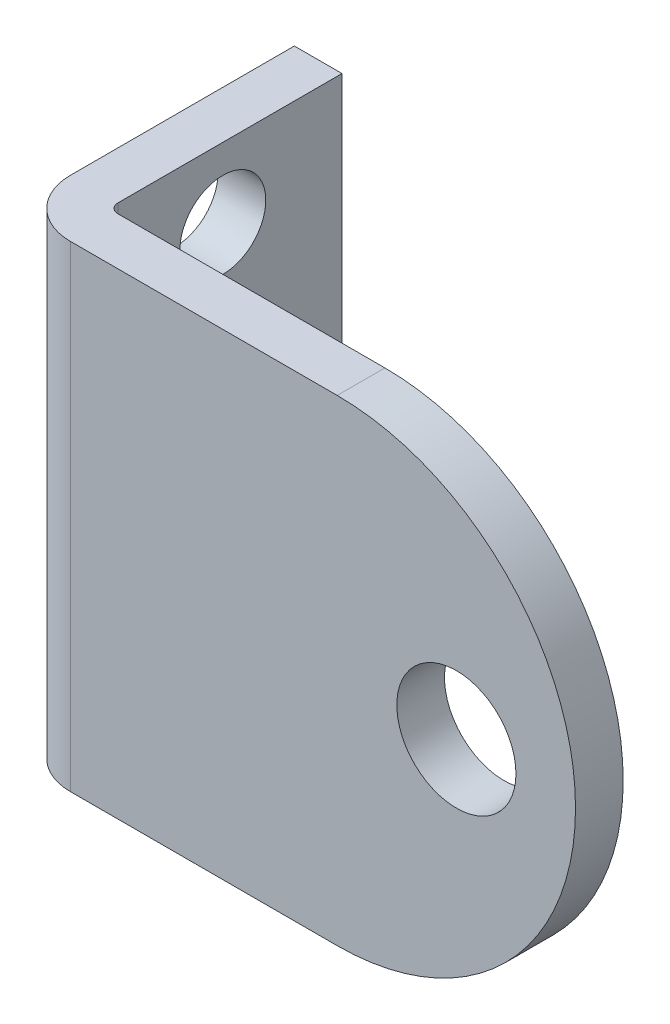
ISO-10303-21;
HEADER;
FILE_DESCRIPTION(('STEP AP214'),'2;1');
FILE_NAME('part.step','',(''),(''),'','','');
FILE_SCHEMA(('AUTOMOTIVE_DESIGN { 1 0 10303 214 1 1 1 1 }'));
ENDSEC;
DATA;
#1=APPLICATION_CONTEXT('core data for automotive mechanical design processes');
#2=APPLICATION_PROTOCOL_DEFINITION('international standard','automotive_design',2000,#1);
#3=PRODUCT_CONTEXT('',#1,'mechanical');
#4=PRODUCT('Part','Part','',(#3));
#5=PRODUCT_RELATED_PRODUCT_CATEGORY('part','',(#4));
#6=PRODUCT_DEFINITION_FORMATION('','',#4);
#7=PRODUCT_DEFINITION_CONTEXT('part definition',#1,'design');
#8=PRODUCT_DEFINITION('design','',#6,#7);
#9=PRODUCT_DEFINITION_SHAPE('','',#8);
#10=(LENGTH_UNIT() NAMED_UNIT(*) SI_UNIT(.MILLI.,.METRE.));
#11=(NAMED_UNIT(*) PLANE_ANGLE_UNIT() SI_UNIT($,.RADIAN.));
#12=(NAMED_UNIT(*) SI_UNIT($,.STERADIAN.) SOLID_ANGLE_UNIT());
#13=UNCERTAINTY_MEASURE_WITH_UNIT(LENGTH_MEASURE(1.E-05),#10,'distance_accuracy_value','');
#14=(GEOMETRIC_REPRESENTATION_CONTEXT(3) GLOBAL_UNCERTAINTY_ASSIGNED_CONTEXT((#13)) GLOBAL_UNIT_ASSIGNED_CONTEXT((#10,
#11,#12)) REPRESENTATION_CONTEXT('',''));
#15=CARTESIAN_POINT('',(0.,0.,0.));
#16=DIRECTION('',(0.,0.,1.));
#17=DIRECTION('',(1.,0.,0.));
#18=AXIS2_PLACEMENT_3D('',#15,#16,#17);
#19=CARTESIAN_POINT('',(34.,0.,5.));
#20=DIRECTION('',(0.,0.,-1.));
#21=DIRECTION('',(-1.,0.,0.));
#22=AXIS2_PLACEMENT_3D('',#19,#20,#21);
#23=PLANE('',#22);
#24=DIRECTION('',(-1.,0.,0.));
#25=VECTOR('',#24,1.);
#26=CARTESIAN_POINT('',(0.,25.,5.));
#27=LINE('',#26,#25);
#28=CARTESIAN_POINT('',(34.,25.,5.));
#29=VERTEX_POINT('',#28);
#30=CARTESIAN_POINT('',(6.,25.,5.));
#31=VERTEX_POINT('',#30);
#32=EDGE_CURVE('E156',#29,#31,#27,.T.);
#33=ORIENTED_EDGE('',*,*,#32,.T.);
#34=DIRECTION('',(0.,-1.,0.));
#35=VECTOR('',#34,1.);
#36=CARTESIAN_POINT('',(6.,0.,5.));
#37=LINE('',#36,#35);
#38=CARTESIAN_POINT('',(6.,-25.,5.));
#39=VERTEX_POINT('',#38);
#40=EDGE_CURVE('E110',#31,#39,#37,.T.);
#41=ORIENTED_EDGE('',*,*,#40,.T.);
#42=DIRECTION('',(1.,0.,0.));
#43=VECTOR('',#42,1.);
#44=CARTESIAN_POINT('',(0.,-25.,5.));
#45=LINE('',#44,#43);
#46=CARTESIAN_POINT('',(34.,-25.,5.));
#47=VERTEX_POINT('',#46);
#48=EDGE_CURVE('E152',#39,#47,#45,.T.);
#49=ORIENTED_EDGE('',*,*,#48,.T.);
#50=CARTESIAN_POINT('',(34.,0.,5.));
#51=DIRECTION('',(0.,0.,1.));
#52=DIRECTION('',(-1.,0.,0.));
#53=AXIS2_PLACEMENT_3D('',#50,#51,#52);
#54=CIRCLE('',#53,25.);
#55=EDGE_CURVE('E154',#47,#29,#54,.T.);
#56=ORIENTED_EDGE('',*,*,#55,.T.);
#57=EDGE_LOOP('',(#33,#41,#49,#56));
#58=FACE_BOUND('',#57,.T.);
#59=CARTESIAN_POINT('',(46.5,0.,5.));
#60=DIRECTION('',(0.,0.,1.));
#61=DIRECTION('',(1.,0.,0.));
#62=AXIS2_PLACEMENT_3D('',#59,#60,#61);
#63=CIRCLE('',#62,6.25);
#64=CARTESIAN_POINT('',(52.75,0.,5.));
#65=VERTEX_POINT('',#64);
#66=EDGE_CURVE('E143',#65,#65,#63,.T.);
#67=ORIENTED_EDGE('',*,*,#66,.F.);
#68=EDGE_LOOP('',(#67));
#69=FACE_BOUND('',#68,.T.);
#70=ADVANCED_FACE('F36',(#58,#69),#23,.F.);
#71=CARTESIAN_POINT('',(34.,0.,0.));
#72=DIRECTION('',(0.,0.,-1.));
#73=DIRECTION('',(-1.,0.,0.));
#74=AXIS2_PLACEMENT_3D('',#71,#72,#73);
#75=PLANE('',#74);
#76=DIRECTION('',(1.,0.,0.));
#77=VECTOR('',#76,1.);
#78=CARTESIAN_POINT('',(0.,-25.,0.));
#79=LINE('',#78,#77);
#80=CARTESIAN_POINT('',(6.,-25.,0.));
#81=VERTEX_POINT('',#80);
#82=CARTESIAN_POINT('',(34.,-25.,0.));
#83=VERTEX_POINT('',#82);
#84=EDGE_CURVE('E146',#81,#83,#79,.T.);
#85=ORIENTED_EDGE('',*,*,#84,.F.);
#86=DIRECTION('',(0.,-1.,0.));
#87=VECTOR('',#86,1.);
#88=CARTESIAN_POINT('',(5.99999999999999,25.,0.));
#89=LINE('',#88,#87);
#90=CARTESIAN_POINT('',(5.99999999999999,25.,0.));
#91=VERTEX_POINT('',#90);
#92=EDGE_CURVE('E59',#81,#91,#89,.F.);
#93=ORIENTED_EDGE('',*,*,#92,.T.);
#94=DIRECTION('',(-1.,0.,0.));
#95=VECTOR('',#94,1.);
#96=CARTESIAN_POINT('',(0.,25.,0.));
#97=LINE('',#96,#95);
#98=CARTESIAN_POINT('',(34.,25.,0.));
#99=VERTEX_POINT('',#98);
#100=EDGE_CURVE('E150',#99,#91,#97,.T.);
#101=ORIENTED_EDGE('',*,*,#100,.F.);
#102=CARTESIAN_POINT('',(34.,0.,0.));
#103=DIRECTION('',(0.,0.,1.));
#104=DIRECTION('',(-1.,0.,0.));
#105=AXIS2_PLACEMENT_3D('',#102,#103,#104);
#106=CIRCLE('',#105,25.);
#107=EDGE_CURVE('E148',#83,#99,#106,.T.);
#108=ORIENTED_EDGE('',*,*,#107,.F.);
#109=EDGE_LOOP('',(#85,#93,#101,#108));
#110=FACE_BOUND('',#109,.T.);
#111=CARTESIAN_POINT('',(46.5,0.,0.));
#112=DIRECTION('',(0.,0.,1.));
#113=DIRECTION('',(1.,0.,0.));
#114=AXIS2_PLACEMENT_3D('',#111,#112,#113);
#115=CIRCLE('',#114,6.25);
#116=CARTESIAN_POINT('',(52.75,0.,0.));
#117=VERTEX_POINT('',#116);
#118=EDGE_CURVE('E139',#117,#117,#115,.T.);
#119=ORIENTED_EDGE('',*,*,#118,.T.);
#120=EDGE_LOOP('',(#119));
#121=FACE_BOUND('',#120,.T.);
#122=ADVANCED_FACE('F187',(#110,#121),#75,.T.);
#123=CARTESIAN_POINT('',(0.,25.,5.));
#124=DIRECTION('',(1.,0.,0.));
#125=DIRECTION('',(0.,1.,0.));
#126=AXIS2_PLACEMENT_3D('',#123,#124,#125);
#127=PLANE('',#126);
#128=CARTESIAN_POINT('',(0.,17.5,-12.));
#129=DIRECTION('',(-1.,0.,0.));
#130=DIRECTION('',(0.,-1.,0.));
#131=AXIS2_PLACEMENT_3D('',#128,#129,#130);
#132=CIRCLE('',#131,4.5);
#133=CARTESIAN_POINT('',(0.,13.,-12.));
#134=VERTEX_POINT('',#133);
#135=EDGE_CURVE('E230',#134,#134,#132,.T.);
#136=ORIENTED_EDGE('',*,*,#135,.F.);
#137=EDGE_LOOP('',(#136));
#138=FACE_BOUND('',#137,.T.);
#139=CARTESIAN_POINT('',(0.,-17.5,-12.));
#140=DIRECTION('',(-1.,0.,0.));
#141=DIRECTION('',(0.,-1.,0.));
#142=AXIS2_PLACEMENT_3D('',#139,#140,#141);
#143=CIRCLE('',#142,4.5);
#144=CARTESIAN_POINT('',(0.,-22.,-12.));
#145=VERTEX_POINT('',#144);
#146=EDGE_CURVE('E128',#145,#145,#143,.T.);
#147=ORIENTED_EDGE('',*,*,#146,.F.);
#148=EDGE_LOOP('',(#147));
#149=FACE_BOUND('',#148,.T.);
#150=DIRECTION('',(0.,0.,-1.));
#151=VECTOR('',#150,1.);
#152=CARTESIAN_POINT('',(0.,-25.,5.));
#153=LINE('',#152,#151);
#154=CARTESIAN_POINT('',(0.,-25.,-1.));
#155=VERTEX_POINT('',#154);
#156=CARTESIAN_POINT('',(0.,-25.,-24.5));
#157=VERTEX_POINT('',#156);
#158=EDGE_CURVE('E101',#155,#157,#153,.T.);
#159=ORIENTED_EDGE('',*,*,#158,.F.);
#160=DIRECTION('',(0.,-1.,0.));
#161=VECTOR('',#160,1.);
#162=CARTESIAN_POINT('',(0.,25.,-1.));
#163=LINE('',#162,#161);
#164=CARTESIAN_POINT('',(0.,25.,-1.));
#165=VERTEX_POINT('',#164);
#166=EDGE_CURVE('E168',#155,#165,#163,.F.);
#167=ORIENTED_EDGE('',*,*,#166,.T.);
#168=DIRECTION('',(0.,0.,-1.));
#169=VECTOR('',#168,1.);
#170=CARTESIAN_POINT('',(0.,25.,5.));
#171=LINE('',#170,#169);
#172=CARTESIAN_POINT('',(0.,25.,-24.5));
#173=VERTEX_POINT('',#172);
#174=EDGE_CURVE('E124',#165,#173,#171,.T.);
#175=ORIENTED_EDGE('',*,*,#174,.T.);
#176=DIRECTION('',(0.,-1.,0.));
#177=VECTOR('',#176,1.);
#178=CARTESIAN_POINT('',(0.,25.,-24.5));
#179=LINE('',#178,#177);
#180=EDGE_CURVE('E118',#173,#157,#179,.T.);
#181=ORIENTED_EDGE('',*,*,#180,.T.);
#182=EDGE_LOOP('',(#159,#167,#175,#181));
#183=FACE_BOUND('',#182,.T.);
#184=ADVANCED_FACE('F38',(#138,#149,#183),#127,.F.);
#185=CARTESIAN_POINT('',(0.,-25.,5.));
#186=DIRECTION('',(0.,1.,0.));
#187=DIRECTION('',(0.,0.,1.));
#188=AXIS2_PLACEMENT_3D('',#185,#186,#187);
#189=PLANE('',#188);
#190=ORIENTED_EDGE('',*,*,#48,.F.);
#191=CARTESIAN_POINT('',(6.,-25.,-1.));
#192=DIRECTION('',(0.,1.,0.));
#193=DIRECTION('',(0.,0.,1.));
#194=AXIS2_PLACEMENT_3D('',#191,#192,#193);
#195=CIRCLE('',#194,6.);
#196=EDGE_CURVE('E106',#39,#155,#195,.F.);
#197=ORIENTED_EDGE('',*,*,#196,.T.);
#198=ORIENTED_EDGE('',*,*,#158,.T.);
#199=DIRECTION('',(1.,0.,0.));
#200=VECTOR('',#199,1.);
#201=CARTESIAN_POINT('',(0.,-25.,-24.5));
#202=LINE('',#201,#200);
#203=CARTESIAN_POINT('',(5.,-25.,-24.5));
#204=VERTEX_POINT('',#203);
#205=EDGE_CURVE('E105',#157,#204,#202,.T.);
#206=ORIENTED_EDGE('',*,*,#205,.T.);
#207=DIRECTION('',(0.,0.,1.));
#208=VECTOR('',#207,1.);
#209=CARTESIAN_POINT('',(5.,-25.,-24.5));
#210=LINE('',#209,#208);
#211=CARTESIAN_POINT('',(5.,-25.,-1.));
#212=VERTEX_POINT('',#211);
#213=EDGE_CURVE('E135',#204,#212,#210,.T.);
#214=ORIENTED_EDGE('',*,*,#213,.T.);
#215=CARTESIAN_POINT('',(6.,-25.,-1.));
#216=DIRECTION('',(0.,1.,0.));
#217=DIRECTION('',(0.,0.,1.));
#218=AXIS2_PLACEMENT_3D('',#215,#216,#217);
#219=CIRCLE('',#218,1.);
#220=EDGE_CURVE('E45',#212,#81,#219,.T.);
#221=ORIENTED_EDGE('',*,*,#220,.T.);
#222=ORIENTED_EDGE('',*,*,#84,.T.);
#223=DIRECTION('',(0.,0.,-1.));
#224=VECTOR('',#223,1.);
#225=CARTESIAN_POINT('',(34.,-25.,5.));
#226=LINE('',#225,#224);
#227=EDGE_CURVE('E111',#47,#83,#226,.T.);
#228=ORIENTED_EDGE('',*,*,#227,.F.);
#229=EDGE_LOOP('',(#190,#197,#198,#206,#214,#221,#222,#228));
#230=FACE_BOUND('',#229,.T.);
#231=ADVANCED_FACE('F104',(#230),#189,.F.);
#232=CARTESIAN_POINT('',(34.,0.,5.));
#233=DIRECTION('',(0.,0.,-1.));
#234=DIRECTION('',(-1.,0.,0.));
#235=AXIS2_PLACEMENT_3D('',#232,#233,#234);
#236=CYLINDRICAL_SURFACE('',#235,25.);
#237=ORIENTED_EDGE('',*,*,#107,.T.);
#238=DIRECTION('',(0.,0.,-1.));
#239=VECTOR('',#238,1.);
#240=CARTESIAN_POINT('',(34.,25.,5.));
#241=LINE('',#240,#239);
#242=EDGE_CURVE('E160',#29,#99,#241,.T.);
#243=ORIENTED_EDGE('',*,*,#242,.F.);
#244=ORIENTED_EDGE('',*,*,#55,.F.);
#245=ORIENTED_EDGE('',*,*,#227,.T.);
#246=EDGE_LOOP('',(#237,#243,#244,#245));
#247=FACE_BOUND('',#246,.T.);
#248=ADVANCED_FACE('F190',(#247),#236,.T.);
#249=CARTESIAN_POINT('',(0.,25.,5.));
#250=DIRECTION('',(0.,-1.,0.));
#251=DIRECTION('',(0.,0.,-1.));
#252=AXIS2_PLACEMENT_3D('',#249,#250,#251);
#253=PLANE('',#252);
#254=ORIENTED_EDGE('',*,*,#174,.F.);
#255=CARTESIAN_POINT('',(5.99999999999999,25.,-1.));
#256=DIRECTION('',(0.,-1.,0.));
#257=DIRECTION('',(0.,0.,-1.));
#258=AXIS2_PLACEMENT_3D('',#255,#256,#257);
#259=CIRCLE('',#258,6.);
#260=EDGE_CURVE('E170',#165,#31,#259,.F.);
#261=ORIENTED_EDGE('',*,*,#260,.T.);
#262=ORIENTED_EDGE('',*,*,#32,.F.);
#263=ORIENTED_EDGE('',*,*,#242,.T.);
#264=ORIENTED_EDGE('',*,*,#100,.T.);
#265=CARTESIAN_POINT('',(5.99999999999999,25.,-1.));
#266=DIRECTION('',(0.,-1.,0.));
#267=DIRECTION('',(0.,0.,-1.));
#268=AXIS2_PLACEMENT_3D('',#265,#266,#267);
#269=CIRCLE('',#268,1.);
#270=CARTESIAN_POINT('',(4.99999999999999,25.,-1.));
#271=VERTEX_POINT('',#270);
#272=EDGE_CURVE('E11',#91,#271,#269,.T.);
#273=ORIENTED_EDGE('',*,*,#272,.T.);
#274=DIRECTION('',(0.,0.,1.));
#275=VECTOR('',#274,1.);
#276=CARTESIAN_POINT('',(4.99999999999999,25.,-24.5));
#277=LINE('',#276,#275);
#278=CARTESIAN_POINT('',(4.99999999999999,25.,-24.5));
#279=VERTEX_POINT('',#278);
#280=EDGE_CURVE('E136',#279,#271,#277,.T.);
#281=ORIENTED_EDGE('',*,*,#280,.F.);
#282=DIRECTION('',(-1.,0.,0.));
#283=VECTOR('',#282,1.);
#284=CARTESIAN_POINT('',(0.,25.,-24.5));
#285=LINE('',#284,#283);
#286=EDGE_CURVE('E133',#279,#173,#285,.T.);
#287=ORIENTED_EDGE('',*,*,#286,.T.);
#288=EDGE_LOOP('',(#254,#261,#262,#263,#264,#273,#281,#287));
#289=FACE_BOUND('',#288,.T.);
#290=ADVANCED_FACE('F183',(#289),#253,.F.);
#291=CARTESIAN_POINT('',(46.5,0.,5.));
#292=DIRECTION('',(0.,0.,-1.));
#293=DIRECTION('',(-1.,0.,0.));
#294=AXIS2_PLACEMENT_3D('',#291,#292,#293);
#295=CYLINDRICAL_SURFACE('',#294,6.25);
#296=ORIENTED_EDGE('',*,*,#66,.T.);
#297=EDGE_LOOP('',(#296));
#298=FACE_BOUND('',#297,.T.);
#299=ORIENTED_EDGE('',*,*,#118,.F.);
#300=EDGE_LOOP('',(#299));
#301=FACE_BOUND('',#300,.T.);
#302=ADVANCED_FACE('F218',(#298,#301),#295,.F.);
#303=CARTESIAN_POINT('',(4.99999999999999,25.,-24.5));
#304=DIRECTION('',(1.,0.,0.));
#305=DIRECTION('',(0.,1.,0.));
#306=AXIS2_PLACEMENT_3D('',#303,#304,#305);
#307=PLANE('',#306);
#308=CARTESIAN_POINT('',(5.,17.5,-12.));
#309=DIRECTION('',(1.,0.,0.));
#310=DIRECTION('',(0.,1.,0.));
#311=AXIS2_PLACEMENT_3D('',#308,#309,#310);
#312=CIRCLE('',#311,4.5);
#313=CARTESIAN_POINT('',(5.,13.,-12.));
#314=VERTEX_POINT('',#313);
#315=EDGE_CURVE('E40',#314,#314,#312,.T.);
#316=ORIENTED_EDGE('',*,*,#315,.F.);
#317=EDGE_LOOP('',(#316));
#318=FACE_BOUND('',#317,.T.);
#319=CARTESIAN_POINT('',(5.,-17.5,-12.));
#320=DIRECTION('',(1.,0.,0.));
#321=DIRECTION('',(0.,1.,0.));
#322=AXIS2_PLACEMENT_3D('',#319,#320,#321);
#323=CIRCLE('',#322,4.5);
#324=CARTESIAN_POINT('',(5.,-22.,-12.));
#325=VERTEX_POINT('',#324);
#326=EDGE_CURVE('E125',#325,#325,#323,.T.);
#327=ORIENTED_EDGE('',*,*,#326,.F.);
#328=EDGE_LOOP('',(#327));
#329=FACE_BOUND('',#328,.T.);
#330=ORIENTED_EDGE('',*,*,#280,.T.);
#331=DIRECTION('',(0.,-1.,0.));
#332=VECTOR('',#331,1.);
#333=CARTESIAN_POINT('',(5.,-25.,-1.));
#334=LINE('',#333,#332);
#335=EDGE_CURVE('E172',#271,#212,#334,.T.);
#336=ORIENTED_EDGE('',*,*,#335,.T.);
#337=ORIENTED_EDGE('',*,*,#213,.F.);
#338=DIRECTION('',(0.,1.,0.));
#339=VECTOR('',#338,1.);
#340=CARTESIAN_POINT('',(4.99999999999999,25.,-24.5));
#341=LINE('',#340,#339);
#342=EDGE_CURVE('E121',#204,#279,#341,.T.);
#343=ORIENTED_EDGE('',*,*,#342,.T.);
#344=EDGE_LOOP('',(#330,#336,#337,#343));
#345=FACE_BOUND('',#344,.T.);
#346=ADVANCED_FACE('F178',(#318,#329,#345),#307,.T.);
#347=CARTESIAN_POINT('',(0.,-25.,-24.5));
#348=DIRECTION('',(0.,0.,1.));
#349=DIRECTION('',(1.,0.,0.));
#350=AXIS2_PLACEMENT_3D('',#347,#348,#349);
#351=PLANE('',#350);
#352=ORIENTED_EDGE('',*,*,#180,.F.);
#353=ORIENTED_EDGE('',*,*,#286,.F.);
#354=ORIENTED_EDGE('',*,*,#342,.F.);
#355=ORIENTED_EDGE('',*,*,#205,.F.);
#356=EDGE_LOOP('',(#352,#353,#354,#355));
#357=FACE_BOUND('',#356,.T.);
#358=ADVANCED_FACE('F116',(#357),#351,.F.);
#359=CARTESIAN_POINT('',(6.,0.,-1.));
#360=DIRECTION('',(0.,-1.,0.));
#361=DIRECTION('',(1.,0.,0.));
#362=AXIS2_PLACEMENT_3D('',#359,#360,#361);
#363=CYLINDRICAL_SURFACE('',#362,6.);
#364=ORIENTED_EDGE('',*,*,#260,.F.);
#365=ORIENTED_EDGE('',*,*,#166,.F.);
#366=ORIENTED_EDGE('',*,*,#196,.F.);
#367=ORIENTED_EDGE('',*,*,#40,.F.);
#368=EDGE_LOOP('',(#364,#365,#366,#367));
#369=FACE_BOUND('',#368,.T.);
#370=ADVANCED_FACE('F198',(#369),#363,.T.);
#371=CARTESIAN_POINT('',(5.99999999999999,25.,-1.));
#372=DIRECTION('',(0.,1.,0.));
#373=DIRECTION('',(-1.,0.,0.));
#374=AXIS2_PLACEMENT_3D('',#371,#372,#373);
#375=CYLINDRICAL_SURFACE('',#374,1.);
#376=ORIENTED_EDGE('',*,*,#272,.F.);
#377=ORIENTED_EDGE('',*,*,#92,.F.);
#378=ORIENTED_EDGE('',*,*,#220,.F.);
#379=ORIENTED_EDGE('',*,*,#335,.F.);
#380=EDGE_LOOP('',(#376,#377,#378,#379));
#381=FACE_BOUND('',#380,.T.);
#382=ADVANCED_FACE('F181',(#381),#375,.F.);
#383=CARTESIAN_POINT('',(59.,-17.5,-12.));
#384=DIRECTION('',(-1.,0.,0.));
#385=DIRECTION('',(0.,-1.,0.));
#386=AXIS2_PLACEMENT_3D('',#383,#384,#385);
#387=CYLINDRICAL_SURFACE('',#386,4.5);
#388=CARTESIAN_POINT('',(5.,-22.,-12.));
#389=CARTESIAN_POINT('',(4.94791666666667,-22.,-12.));
#390=CARTESIAN_POINT('',(4.89583333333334,-22.,-12.));
#391=CARTESIAN_POINT('',(4.79166666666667,-22.,-12.));
#392=CARTESIAN_POINT('',(4.73958333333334,-22.,-12.));
#393=CARTESIAN_POINT('',(4.63541666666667,-22.,-12.));
#394=CARTESIAN_POINT('',(4.58333333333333,-22.,-12.));
#395=CARTESIAN_POINT('',(4.47916666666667,-22.,-12.));
#396=CARTESIAN_POINT('',(4.42708333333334,-22.,-12.));
#397=CARTESIAN_POINT('',(4.32291666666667,-22.,-12.));
#398=CARTESIAN_POINT('',(4.27083333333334,-22.,-12.));
#399=CARTESIAN_POINT('',(4.16666666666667,-22.,-12.));
#400=CARTESIAN_POINT('',(4.11458333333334,-22.,-12.));
#401=CARTESIAN_POINT('',(4.01041666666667,-22.,-12.));
#402=CARTESIAN_POINT('',(3.95833333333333,-22.,-12.));
#403=CARTESIAN_POINT('',(3.85416666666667,-22.,-12.));
#404=CARTESIAN_POINT('',(3.80208333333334,-22.,-12.));
#405=CARTESIAN_POINT('',(3.69791666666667,-22.,-12.));
#406=CARTESIAN_POINT('',(3.64583333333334,-22.,-12.));
#407=CARTESIAN_POINT('',(3.54166666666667,-22.,-12.));
#408=CARTESIAN_POINT('',(3.48958333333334,-22.,-12.));
#409=CARTESIAN_POINT('',(3.38541666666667,-22.,-12.));
#410=CARTESIAN_POINT('',(3.33333333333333,-22.,-12.));
#411=CARTESIAN_POINT('',(3.22916666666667,-22.,-12.));
#412=CARTESIAN_POINT('',(3.17708333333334,-22.,-12.));
#413=CARTESIAN_POINT('',(3.07291666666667,-22.,-12.));
#414=CARTESIAN_POINT('',(3.02083333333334,-22.,-12.));
#415=CARTESIAN_POINT('',(2.91666666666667,-22.,-12.));
#416=CARTESIAN_POINT('',(2.86458333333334,-22.,-12.));
#417=CARTESIAN_POINT('',(2.76041666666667,-22.,-12.));
#418=CARTESIAN_POINT('',(2.70833333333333,-22.,-12.));
#419=CARTESIAN_POINT('',(2.60416666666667,-22.,-12.));
#420=CARTESIAN_POINT('',(2.55208333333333,-22.,-12.));
#421=CARTESIAN_POINT('',(2.44791666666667,-22.,-12.));
#422=CARTESIAN_POINT('',(2.39583333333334,-22.,-12.));
#423=CARTESIAN_POINT('',(2.29166666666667,-22.,-12.));
#424=CARTESIAN_POINT('',(2.23958333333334,-22.,-12.));
#425=CARTESIAN_POINT('',(2.13541666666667,-22.,-12.));
#426=CARTESIAN_POINT('',(2.08333333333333,-22.,-12.));
#427=CARTESIAN_POINT('',(1.97916666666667,-22.,-12.));
#428=CARTESIAN_POINT('',(1.92708333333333,-22.,-12.));
#429=CARTESIAN_POINT('',(1.82291666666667,-22.,-12.));
#430=CARTESIAN_POINT('',(1.77083333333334,-22.,-12.));
#431=CARTESIAN_POINT('',(1.66666666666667,-22.,-12.));
#432=CARTESIAN_POINT('',(1.61458333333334,-22.,-12.));
#433=CARTESIAN_POINT('',(1.51041666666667,-22.,-12.));
#434=CARTESIAN_POINT('',(1.45833333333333,-22.,-12.));
#435=CARTESIAN_POINT('',(1.35416666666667,-22.,-12.));
#436=CARTESIAN_POINT('',(1.30208333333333,-22.,-12.));
#437=CARTESIAN_POINT('',(1.19791666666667,-22.,-12.));
#438=CARTESIAN_POINT('',(1.14583333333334,-22.,-12.));
#439=CARTESIAN_POINT('',(1.04166666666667,-22.,-12.));
#440=CARTESIAN_POINT('',(0.989583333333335,-22.,-12.));
#441=CARTESIAN_POINT('',(0.885416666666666,-22.,-12.));
#442=CARTESIAN_POINT('',(0.833333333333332,-22.,-12.));
#443=CARTESIAN_POINT('',(0.729166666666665,-22.,-12.));
#444=CARTESIAN_POINT('',(0.677083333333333,-22.,-12.));
#445=CARTESIAN_POINT('',(0.572916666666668,-22.,-12.));
#446=CARTESIAN_POINT('',(0.520833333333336,-22.,-12.));
#447=CARTESIAN_POINT('',(0.416666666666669,-22.,-12.));
#448=CARTESIAN_POINT('',(0.364583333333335,-22.,-12.));
#449=CARTESIAN_POINT('',(0.260416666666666,-22.,-12.));
#450=CARTESIAN_POINT('',(0.208333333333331,-22.,-12.));
#451=CARTESIAN_POINT('',(0.104166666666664,-22.,-12.));
#452=CARTESIAN_POINT('',(0.0520833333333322,-22.,-12.));
#453=CARTESIAN_POINT('',(0.,-22.,-12.));
#454=B_SPLINE_CURVE_WITH_KNOTS('',3,(#388,#389,#390,#391,#392,#393,#394,#395,#396,#397,#398,
#399,#400,#401,#402,#403,#404,#405,#406,#407,#408,#409,#410,#411,#412,#413,#414,#415,#416,#417,
#418,#419,#420,#421,#422,#423,#424,#425,#426,#427,#428,#429,#430,#431,#432,#433,#434,#435,#436,
#437,#438,#439,#440,#441,#442,#443,#444,#445,#446,#447,#448,#449,#450,#451,#452,#453),
.UNSPECIFIED.,.F.,.F.,(4,2,2,2,2,2,2,2,2,2,2,2,2,2,2,2,2,2,2,2,2,2,2,2,2,2,2,2,2,2,2,2,4),(0.,
0.156249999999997,0.3125,0.468750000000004,0.625000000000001,0.781249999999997,
0.937500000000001,1.09375,1.25,1.40625,1.5625,1.71875,1.875,2.03125,2.1875,2.34375000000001,2.5,
2.65625,2.8125,2.96875000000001,3.125,3.28125,3.4375,3.59375000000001,3.75,3.90625,4.0625,
4.21875000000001,4.375,4.53125,4.6875,4.84375000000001,5.),.UNSPECIFIED.);
#455=EDGE_CURVE('BSEAM205',#325,#145,#454,.T.);
#456=ORIENTED_EDGE('',*,*,#326,.T.);
#457=ORIENTED_EDGE('',*,*,#146,.T.);
#458=ORIENTED_EDGE('',*,*,#455,.T.);
#459=ORIENTED_EDGE('',*,*,#455,.F.);
#460=EDGE_LOOP('',(#456,#458,#457,#459));
#461=FACE_BOUND('',#460,.T.);
#462=ADVANCED_FACE('F205',(#461),#387,.F.);
#463=CARTESIAN_POINT('',(59.,17.5,-12.));
#464=DIRECTION('',(-1.,0.,0.));
#465=DIRECTION('',(0.,-1.,0.));
#466=AXIS2_PLACEMENT_3D('',#463,#464,#465);
#467=CYLINDRICAL_SURFACE('',#466,4.5);
#468=CARTESIAN_POINT('',(5.,13.,-12.));
#469=CARTESIAN_POINT('',(4.94791666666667,13.,-12.));
#470=CARTESIAN_POINT('',(4.89583333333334,13.,-12.));
#471=CARTESIAN_POINT('',(4.79166666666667,13.,-12.));
#472=CARTESIAN_POINT('',(4.73958333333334,13.,-12.));
#473=CARTESIAN_POINT('',(4.63541666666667,13.,-12.));
#474=CARTESIAN_POINT('',(4.58333333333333,13.,-12.));
#475=CARTESIAN_POINT('',(4.47916666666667,13.,-12.));
#476=CARTESIAN_POINT('',(4.42708333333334,13.,-12.));
#477=CARTESIAN_POINT('',(4.32291666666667,13.,-12.));
#478=CARTESIAN_POINT('',(4.27083333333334,13.,-12.));
#479=CARTESIAN_POINT('',(4.16666666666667,13.,-12.));
#480=CARTESIAN_POINT('',(4.11458333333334,13.,-12.));
#481=CARTESIAN_POINT('',(4.01041666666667,13.,-12.));
#482=CARTESIAN_POINT('',(3.95833333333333,13.,-12.));
#483=CARTESIAN_POINT('',(3.85416666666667,13.,-12.));
#484=CARTESIAN_POINT('',(3.80208333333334,13.,-12.));
#485=CARTESIAN_POINT('',(3.69791666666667,13.,-12.));
#486=CARTESIAN_POINT('',(3.64583333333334,13.,-12.));
#487=CARTESIAN_POINT('',(3.54166666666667,13.,-12.));
#488=CARTESIAN_POINT('',(3.48958333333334,13.,-12.));
#489=CARTESIAN_POINT('',(3.38541666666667,13.,-12.));
#490=CARTESIAN_POINT('',(3.33333333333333,13.,-12.));
#491=CARTESIAN_POINT('',(3.22916666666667,13.,-12.));
#492=CARTESIAN_POINT('',(3.17708333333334,13.,-12.));
#493=CARTESIAN_POINT('',(3.07291666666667,13.,-12.));
#494=CARTESIAN_POINT('',(3.02083333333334,13.,-12.));
#495=CARTESIAN_POINT('',(2.91666666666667,13.,-12.));
#496=CARTESIAN_POINT('',(2.86458333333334,13.,-12.));
#497=CARTESIAN_POINT('',(2.76041666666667,13.,-12.));
#498=CARTESIAN_POINT('',(2.70833333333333,13.,-12.));
#499=CARTESIAN_POINT('',(2.60416666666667,13.,-12.));
#500=CARTESIAN_POINT('',(2.55208333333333,13.,-12.));
#501=CARTESIAN_POINT('',(2.44791666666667,13.,-12.));
#502=CARTESIAN_POINT('',(2.39583333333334,13.,-12.));
#503=CARTESIAN_POINT('',(2.29166666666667,13.,-12.));
#504=CARTESIAN_POINT('',(2.23958333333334,13.,-12.));
#505=CARTESIAN_POINT('',(2.13541666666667,13.,-12.));
#506=CARTESIAN_POINT('',(2.08333333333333,13.,-12.));
#507=CARTESIAN_POINT('',(1.97916666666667,13.,-12.));
#508=CARTESIAN_POINT('',(1.92708333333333,13.,-12.));
#509=CARTESIAN_POINT('',(1.82291666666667,13.,-12.));
#510=CARTESIAN_POINT('',(1.77083333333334,13.,-12.));
#511=CARTESIAN_POINT('',(1.66666666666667,13.,-12.));
#512=CARTESIAN_POINT('',(1.61458333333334,13.,-12.));
#513=CARTESIAN_POINT('',(1.51041666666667,13.,-12.));
#514=CARTESIAN_POINT('',(1.45833333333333,13.,-12.));
#515=CARTESIAN_POINT('',(1.35416666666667,13.,-12.));
#516=CARTESIAN_POINT('',(1.30208333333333,13.,-12.));
#517=CARTESIAN_POINT('',(1.19791666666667,13.,-12.));
#518=CARTESIAN_POINT('',(1.14583333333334,13.,-12.));
#519=CARTESIAN_POINT('',(1.04166666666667,13.,-12.));
#520=CARTESIAN_POINT('',(0.989583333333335,13.,-12.));
#521=CARTESIAN_POINT('',(0.885416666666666,13.,-12.));
#522=CARTESIAN_POINT('',(0.833333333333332,13.,-12.));
#523=CARTESIAN_POINT('',(0.729166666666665,13.,-12.));
#524=CARTESIAN_POINT('',(0.677083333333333,13.,-12.));
#525=CARTESIAN_POINT('',(0.572916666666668,13.,-12.));
#526=CARTESIAN_POINT('',(0.520833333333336,13.,-12.));
#527=CARTESIAN_POINT('',(0.416666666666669,13.,-12.));
#528=CARTESIAN_POINT('',(0.364583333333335,13.,-12.));
#529=CARTESIAN_POINT('',(0.260416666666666,13.,-12.));
#530=CARTESIAN_POINT('',(0.208333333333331,13.,-12.));
#531=CARTESIAN_POINT('',(0.104166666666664,13.,-12.));
#532=CARTESIAN_POINT('',(0.0520833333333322,13.,-12.));
#533=CARTESIAN_POINT('',(0.,13.,-12.));
#534=B_SPLINE_CURVE_WITH_KNOTS('',3,(#468,#469,#470,#471,#472,#473,#474,#475,#476,#477,#478,
#479,#480,#481,#482,#483,#484,#485,#486,#487,#488,#489,#490,#491,#492,#493,#494,#495,#496,#497,
#498,#499,#500,#501,#502,#503,#504,#505,#506,#507,#508,#509,#510,#511,#512,#513,#514,#515,#516,
#517,#518,#519,#520,#521,#522,#523,#524,#525,#526,#527,#528,#529,#530,#531,#532,#533),
.UNSPECIFIED.,.F.,.F.,(4,2,2,2,2,2,2,2,2,2,2,2,2,2,2,2,2,2,2,2,2,2,2,2,2,2,2,2,2,2,2,2,4),(0.,
0.156249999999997,0.3125,0.468750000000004,0.625000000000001,0.781249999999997,
0.937500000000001,1.09375,1.25,1.40625,1.5625,1.71875,1.875,2.03125,2.1875,2.34375000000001,2.5,
2.65625,2.8125,2.96875000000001,3.125,3.28125,3.4375,3.59375000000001,3.75,3.90625,4.0625,
4.21875000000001,4.375,4.53125,4.6875,4.84375000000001,5.),.UNSPECIFIED.);
#535=EDGE_CURVE('BSEAM238',#314,#134,#534,.T.);
#536=ORIENTED_EDGE('',*,*,#315,.T.);
#537=ORIENTED_EDGE('',*,*,#135,.T.);
#538=ORIENTED_EDGE('',*,*,#535,.T.);
#539=ORIENTED_EDGE('',*,*,#535,.F.);
#540=EDGE_LOOP('',(#536,#538,#537,#539));
#541=FACE_BOUND('',#540,.T.);
#542=ADVANCED_FACE('F238',(#541),#467,.F.);
#543=CLOSED_SHELL('',(#70,#122,#184,#231,#248,#290,#302,#346,#358,#370,#382,#462,#542));
#544=MANIFOLD_SOLID_BREP('B2',#543);
#545=ADVANCED_BREP_SHAPE_REPRESENTATION('',(#18,#544),#14);
#546=SHAPE_DEFINITION_REPRESENTATION(#9,#545);
ENDSEC;
END-ISO-10303-21;
